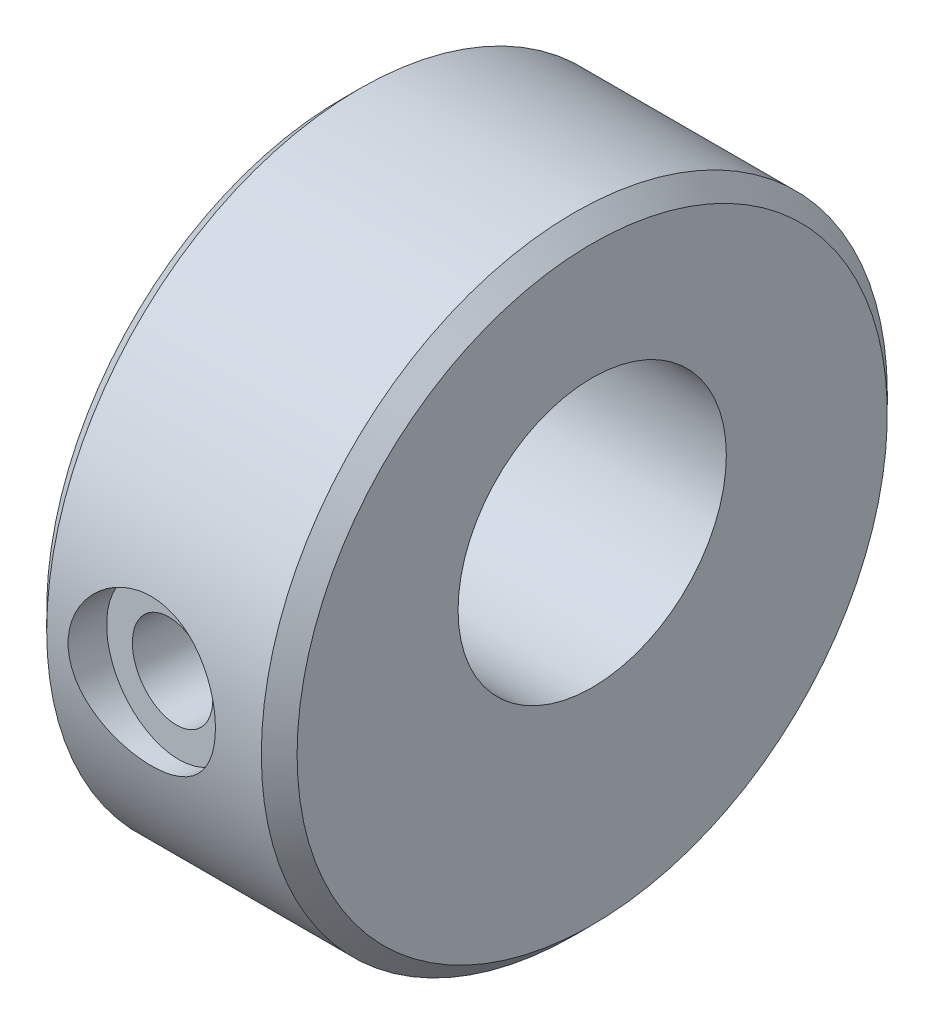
ISO-10303-21;
HEADER;
FILE_DESCRIPTION(('STEP AP214'),'2;1');
FILE_NAME('part.step','',(''),(''),'','','');
FILE_SCHEMA(('AUTOMOTIVE_DESIGN { 1 0 10303 214 1 1 1 1 }'));
ENDSEC;
DATA;
#1=APPLICATION_CONTEXT('core data for automotive mechanical design processes');
#2=APPLICATION_PROTOCOL_DEFINITION('international standard','automotive_design',2000,#1);
#3=PRODUCT_CONTEXT('',#1,'mechanical');
#4=PRODUCT('Part','Part','',(#3));
#5=PRODUCT_RELATED_PRODUCT_CATEGORY('part','',(#4));
#6=PRODUCT_DEFINITION_FORMATION('','',#4);
#7=PRODUCT_DEFINITION_CONTEXT('part definition',#1,'design');
#8=PRODUCT_DEFINITION('design','',#6,#7);
#9=PRODUCT_DEFINITION_SHAPE('','',#8);
#10=(LENGTH_UNIT() NAMED_UNIT(*) SI_UNIT(.MILLI.,.METRE.));
#11=(NAMED_UNIT(*) PLANE_ANGLE_UNIT() SI_UNIT($,.RADIAN.));
#12=(NAMED_UNIT(*) SI_UNIT($,.STERADIAN.) SOLID_ANGLE_UNIT());
#13=UNCERTAINTY_MEASURE_WITH_UNIT(LENGTH_MEASURE(1.E-05),#10,'distance_accuracy_value','');
#14=(GEOMETRIC_REPRESENTATION_CONTEXT(3) GLOBAL_UNCERTAINTY_ASSIGNED_CONTEXT((#13)) GLOBAL_UNIT_ASSIGNED_CONTEXT((#10,
#11,#12)) REPRESENTATION_CONTEXT('',''));
#15=CARTESIAN_POINT('',(0.,0.,0.));
#16=DIRECTION('',(0.,0.,1.));
#17=DIRECTION('',(1.,0.,0.));
#18=AXIS2_PLACEMENT_3D('',#15,#16,#17);
#19=CARTESIAN_POINT('',(6.46646795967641,0.,15.9263391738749));
#20=DIRECTION('',(0.095845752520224,0.,-0.995396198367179));
#21=DIRECTION('',(-0.995396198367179,0.,-0.095845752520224));
#22=AXIS2_PLACEMENT_3D('',#19,#20,#21);
#23=PLANE('',#22);
#24=CARTESIAN_POINT('',(6.46646795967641,0.,15.9263391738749));
#25=DIRECTION('',(-0.095845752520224,0.,0.995396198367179));
#26=DIRECTION('',(0.995396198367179,0.,0.095845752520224));
#27=AXIS2_PLACEMENT_3D('',#24,#25,#26);
#28=CIRCLE('',#27,2.5);
#29=CARTESIAN_POINT('',(8.95495845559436,0.,16.1659535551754));
#30=VERTEX_POINT('',#29);
#31=EDGE_CURVE('E81',#30,#30,#28,.F.);
#32=ORIENTED_EDGE('',*,*,#31,.T.);
#33=EDGE_LOOP('',(#32));
#34=FACE_BOUND('',#33,.T.);
#35=CARTESIAN_POINT('',(6.46646795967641,0.,15.9263391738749));
#36=DIRECTION('',(-0.095845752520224,0.,0.995396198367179));
#37=DIRECTION('',(0.995396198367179,0.,0.095845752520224));
#38=AXIS2_PLACEMENT_3D('',#35,#36,#37);
#39=CIRCLE('',#38,4.1);
#40=CARTESIAN_POINT('',(10.5475923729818,0.,16.3193067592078));
#41=VERTEX_POINT('',#40);
#42=EDGE_CURVE('E19',#41,#41,#39,.T.);
#43=ORIENTED_EDGE('',*,*,#42,.T.);
#44=EDGE_LOOP('',(#43));
#45=FACE_BOUND('',#44,.T.);
#46=ADVANCED_FACE('F15',(#34,#45),#23,.F.);
#47=CARTESIAN_POINT('',(6.37062220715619,0.,16.921735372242));
#48=DIRECTION('',(-0.095845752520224,0.,0.995396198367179));
#49=DIRECTION('',(0.995396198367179,0.,0.095845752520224));
#50=AXIS2_PLACEMENT_3D('',#47,#48,#49);
#51=CYLINDRICAL_SURFACE('',#50,4.1);
#52=CARTESIAN_POINT('',(6.36184056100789,4.1,17.0129362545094));
#53=CARTESIAN_POINT('',(6.47447080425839,4.0999995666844,17.012936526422));
#54=CARTESIAN_POINT('',(6.58711211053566,4.09539781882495,17.0140473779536));
#55=CARTESIAN_POINT('',(6.81163657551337,4.07697108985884,17.0184721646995));
#56=CARTESIAN_POINT('',(6.92351940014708,4.06314228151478,17.021787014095));
#57=CARTESIAN_POINT('',(7.14583961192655,4.02629447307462,17.0305405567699));
#58=CARTESIAN_POINT('',(7.25627477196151,4.00326271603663,17.0359821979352));
#59=CARTESIAN_POINT('',(7.47478490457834,3.94814200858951,17.0488408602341));
#60=CARTESIAN_POINT('',(7.58285898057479,3.91604967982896,17.05625861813));
#61=CARTESIAN_POINT('',(7.79569761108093,3.84307341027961,17.0728493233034));
#62=CARTESIAN_POINT('',(7.90046653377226,3.80220168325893,17.0820198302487));
#63=CARTESIAN_POINT('',(8.1061316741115,3.71193530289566,17.1018615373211));
#64=CARTESIAN_POINT('',(8.20702643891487,3.6625374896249,17.1125332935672));
#65=CARTESIAN_POINT('',(8.50270670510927,3.50211046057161,17.1463462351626));
#66=CARTESIAN_POINT('',(8.69077884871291,3.37874764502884,17.1713089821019));
#67=CARTESIAN_POINT('',(9.04484806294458,3.10176841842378,17.2235003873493));
#68=CARTESIAN_POINT('',(9.21067480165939,2.94793869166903,17.250744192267));
#69=CARTESIAN_POINT('',(9.51456471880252,2.61475267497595,17.3043779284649));
#70=CARTESIAN_POINT('',(9.6526239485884,2.43539276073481,17.3307677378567));
#71=CARTESIAN_POINT('',(9.89942512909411,2.05289513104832,17.3802575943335));
#72=CARTESIAN_POINT('',(10.0076536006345,1.84941806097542,17.4032971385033));
#73=CARTESIAN_POINT('',(10.1888851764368,1.42675912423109,17.4430321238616));
#74=CARTESIAN_POINT('',(10.2618891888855,1.20757766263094,17.4597277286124));
#75=CARTESIAN_POINT('',(10.3705858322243,0.759990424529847,17.4849238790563));
#76=CARTESIAN_POINT('',(10.4063267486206,0.53159698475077,17.4934350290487));
#77=CARTESIAN_POINT('',(10.439643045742,0.0718927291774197,17.501361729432));
#78=CARTESIAN_POINT('',(10.4372204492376,-0.159417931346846,17.500777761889));
#79=CARTESIAN_POINT('',(10.3944684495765,-0.616346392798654,17.4906239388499));
#80=CARTESIAN_POINT('',(10.3544554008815,-0.84199558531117,17.4811290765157));
#81=CARTESIAN_POINT('',(10.2380856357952,-1.28323887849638,17.4542881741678));
#82=CARTESIAN_POINT('',(10.1617273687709,-1.49883254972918,17.4369417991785));
#83=CARTESIAN_POINT('',(9.97443089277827,-1.91469433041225,17.3962009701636));
#84=CARTESIAN_POINT('',(9.86337219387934,-2.11490596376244,17.3727854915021));
#85=CARTESIAN_POINT('',(9.60955807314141,-2.49377633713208,17.3224598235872));
#86=CARTESIAN_POINT('',(9.46680248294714,-2.67243496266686,17.2955496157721));
#87=CARTESIAN_POINT('',(9.23128856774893,-2.92102428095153,17.2547037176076));
#88=CARTESIAN_POINT('',(9.1488122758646,-3.00096065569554,17.2409470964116));
#89=CARTESIAN_POINT('',(8.97733751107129,-3.1535314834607,17.2136930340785));
#90=CARTESIAN_POINT('',(8.88834150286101,-3.22616867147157,17.2001954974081));
#91=CARTESIAN_POINT('',(8.70435177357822,-3.36366698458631,17.1738363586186));
#92=CARTESIAN_POINT('',(8.6093538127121,-3.42852251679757,17.1609752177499));
#93=CARTESIAN_POINT('',(8.41410062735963,-3.54990580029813,17.1362774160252));
#94=CARTESIAN_POINT('',(8.31384748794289,-3.60643682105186,17.1244403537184));
#95=CARTESIAN_POINT('',(8.10950174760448,-3.7103990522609,17.1022146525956));
#96=CARTESIAN_POINT('',(8.00544236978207,-3.75789344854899,17.0918161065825));
#97=CARTESIAN_POINT('',(7.79358321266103,-3.84392353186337,17.0726739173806));
#98=CARTESIAN_POINT('',(7.68578492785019,-3.88246275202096,17.0639296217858));
#99=CARTESIAN_POINT('',(7.46736001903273,-3.95027614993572,17.0483585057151));
#100=CARTESIAN_POINT('',(7.35673795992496,-3.97956437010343,17.0415287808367));
#101=CARTESIAN_POINT('',(7.13336188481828,-4.02874578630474,17.0299691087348));
#102=CARTESIAN_POINT('',(7.02060882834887,-4.04864311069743,17.0252382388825));
#103=CARTESIAN_POINT('',(6.81686348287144,-4.07586013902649,17.0187400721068));
#104=CARTESIAN_POINT('',(6.72611164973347,-4.08491528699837,17.0165656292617));
#105=CARTESIAN_POINT('',(6.54418920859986,-4.09698529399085,17.0136636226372));
#106=CARTESIAN_POINT('',(6.45301862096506,-4.10000044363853,17.0129359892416));
#107=CARTESIAN_POINT('',(6.24594192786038,-4.09999943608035,17.0129365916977));
#108=CARTESIAN_POINT('',(6.13003122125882,-4.09512640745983,17.0141130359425));
#109=CARTESIAN_POINT('',(5.89902443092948,-4.075727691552,17.0187702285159));
#110=CARTESIAN_POINT('',(5.78392874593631,-4.06119757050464,17.0222520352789));
#111=CARTESIAN_POINT('',(5.55523368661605,-4.02261661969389,17.0314107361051));
#112=CARTESIAN_POINT('',(5.44163703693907,-3.99855041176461,17.037091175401));
#113=CARTESIAN_POINT('',(5.21692003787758,-3.94114166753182,17.0504621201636));
#114=CARTESIAN_POINT('',(5.10580067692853,-3.90779549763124,17.0581534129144));
#115=CARTESIAN_POINT('',(4.77788556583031,-3.79442626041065,17.0838640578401));
#116=CARTESIAN_POINT('',(4.56577860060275,-3.70094356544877,17.1045527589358));
#117=CARTESIAN_POINT('',(4.16025234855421,-3.48098245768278,17.150664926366));
#118=CARTESIAN_POINT('',(3.9668278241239,-3.35451332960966,17.1760870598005));
#119=CARTESIAN_POINT('',(3.59896117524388,-3.06833558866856,17.2295377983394));
#120=CARTESIAN_POINT('',(3.4250946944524,-2.9078937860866,17.2576147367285));
#121=CARTESIAN_POINT('',(3.10688796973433,-2.55978508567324,17.3126685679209));
#122=CARTESIAN_POINT('',(2.96255056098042,-2.37211557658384,17.3396453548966));
#123=CARTESIAN_POINT('',(2.70816837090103,-1.9746581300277,17.3893851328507));
#124=CARTESIAN_POINT('',(2.59807233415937,-1.764903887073,17.4121544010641));
#125=CARTESIAN_POINT('',(2.4159101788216,-1.32889928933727,17.4508400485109));
#126=CARTESIAN_POINT('',(2.34383147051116,-1.10265442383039,17.4667586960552));
#127=CARTESIAN_POINT('',(2.24281693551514,-0.650438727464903,17.4893103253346));
#128=CARTESIAN_POINT('',(2.21217200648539,-0.424867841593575,17.4963104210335));
#129=CARTESIAN_POINT('',(2.18964221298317,0.028280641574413,17.5014426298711));
#130=CARTESIAN_POINT('',(2.19774895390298,0.255857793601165,17.4995766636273));
#131=CARTESIAN_POINT('',(2.25146078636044,0.698657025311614,17.4874059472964));
#132=CARTESIAN_POINT('',(2.29582400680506,0.914039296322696,17.4773807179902));
#133=CARTESIAN_POINT('',(2.41880561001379,1.33430924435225,17.4503293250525));
#134=CARTESIAN_POINT('',(2.49742671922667,1.53919608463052,17.4333026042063));
#135=CARTESIAN_POINT('',(2.68777805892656,1.93641824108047,17.3937000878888));
#136=CARTESIAN_POINT('',(2.80001805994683,2.12850018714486,17.3710398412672));
#137=CARTESIAN_POINT('',(3.05366180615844,2.49188595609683,17.3226488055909));
#138=CARTESIAN_POINT('',(3.1950704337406,2.66318629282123,17.2969175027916));
#139=CARTESIAN_POINT('',(3.51018585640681,2.98837848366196,17.2437812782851));
#140=CARTESIAN_POINT('',(3.6850672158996,3.14112743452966,17.2163534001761));
#141=CARTESIAN_POINT('',(4.05800468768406,3.41608690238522,17.1639162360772));
#142=CARTESIAN_POINT('',(4.25607495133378,3.5382786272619,17.1389084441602));
#143=CARTESIAN_POINT('',(4.56895350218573,3.69734913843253,17.1050468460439));
#144=CARTESIAN_POINT('',(4.67734001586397,3.74679700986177,17.09425669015));
#145=CARTESIAN_POINT('',(4.89802811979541,3.8363916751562,17.0743729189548));
#146=CARTESIAN_POINT('',(5.01032818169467,3.87654205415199,17.0652786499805));
#147=CARTESIAN_POINT('',(5.23785549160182,3.94713584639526,17.0490887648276));
#148=CARTESIAN_POINT('',(5.35307728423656,3.97759609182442,17.0419896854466));
#149=CARTESIAN_POINT('',(5.58576028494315,4.02860686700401,17.0300034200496));
#150=CARTESIAN_POINT('',(5.70322035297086,4.04916230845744,17.0251151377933));
#151=CARTESIAN_POINT('',(5.91090930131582,4.07640222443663,17.0186099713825));
#152=CARTESIAN_POINT('',(6.0008461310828,4.08524006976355,17.0164875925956));
#153=CARTESIAN_POINT('',(6.18113310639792,4.09703928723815,17.0136505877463));
#154=CARTESIAN_POINT('',(6.27148327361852,4.10000034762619,17.0129360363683));
#155=CARTESIAN_POINT('',(6.36184056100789,4.1,17.0129362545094));
#156=B_SPLINE_CURVE_WITH_KNOTS('',3,(#52,#53,#54,#55,#56,#57,#58,#59,#60,#61,#62,#63,#64,#65,
#66,#67,#68,#69,#70,#71,#72,#73,#74,#75,#76,#77,#78,#79,#80,#81,#82,#83,#84,#85,#86,#87,#88,#89,
#90,#91,#92,#93,#94,#95,#96,#97,#98,#99,#100,#101,#102,#103,#104,#105,#106,#107,#108,#109,#110,
#111,#112,#113,#114,#115,#116,#117,#118,#119,#120,#121,#122,#123,#124,#125,#126,#127,#128,#129,
#130,#131,#132,#133,#134,#135,#136,#137,#138,#139,#140,#141,#142,#143,#144,#145,#146,#147,#148,
#149,#150,#151,#152,#153,#154,#155),.UNSPECIFIED.,.T.,.F.,(4,2,2,2,2,2,2,2,2,2,2,2,2,2,2,2,2,2,
2,2,2,2,2,2,2,2,2,2,2,2,2,2,2,2,2,2,2,2,2,2,2,2,2,2,2,2,2,2,2,2,2,4),(0.,0.337809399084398,
0.675759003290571,1.01417870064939,1.35272474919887,1.69080283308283,2.02900648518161,
2.70450038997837,3.38490257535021,4.06540144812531,4.75697084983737,5.44852241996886,
6.13917675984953,6.82979449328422,7.51465168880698,8.19953810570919,8.88682958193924,
9.57412470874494,9.92081784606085,10.2673805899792,10.6141909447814,10.9608647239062,
11.3050174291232,11.6490341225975,11.9925260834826,12.3358668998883,12.6093461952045,
12.8828123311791,13.2304217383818,13.5781908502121,13.9265230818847,14.2749918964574,
14.9696607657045,15.6641343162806,16.3754873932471,17.0869087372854,17.7972599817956,
18.5073758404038,19.1872019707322,19.866880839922,20.5242089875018,21.1815894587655,
21.849491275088,22.5175049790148,23.2158359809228,23.9145953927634,24.2730957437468,
24.6314576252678,24.9891935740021,25.3467519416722,25.6177441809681,25.8887507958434),.UNSPECIFIED.);
#157=CARTESIAN_POINT('',(6.36184056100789,4.1,17.0129362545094));
#158=VERTEX_POINT('',#157);
#159=EDGE_CURVE('E44',#158,#158,#156,.T.);
#160=ORIENTED_EDGE('',*,*,#159,.F.);
#161=EDGE_LOOP('',(#160));
#162=FACE_BOUND('',#161,.T.);
#163=ORIENTED_EDGE('',*,*,#42,.F.);
#164=EDGE_LOOP('',(#163));
#165=FACE_BOUND('',#164,.T.);
#166=ADVANCED_FACE('F91',(#162,#165),#51,.F.);
#167=CARTESIAN_POINT('',(13.,0.,0.));
#168=DIRECTION('',(-1.,0.,0.));
#169=DIRECTION('',(0.,0.,1.));
#170=AXIS2_PLACEMENT_3D('',#167,#168,#169);
#171=CONICAL_SURFACE('',#170,17.5,0.785398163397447);
#172=CARTESIAN_POINT('',(13.,0.,0.));
#173=DIRECTION('',(1.,0.,0.));
#174=DIRECTION('',(0.,0.,-1.));
#175=AXIS2_PLACEMENT_3D('',#172,#173,#174);
#176=CIRCLE('',#175,17.5);
#177=CARTESIAN_POINT('',(13.,0.,-17.5));
#178=VERTEX_POINT('',#177);
#179=EDGE_CURVE('E31',#178,#178,#176,.F.);
#180=ORIENTED_EDGE('',*,*,#179,.F.);
#181=EDGE_LOOP('',(#180));
#182=FACE_BOUND('',#181,.T.);
#183=CARTESIAN_POINT('',(14.,0.,0.));
#184=DIRECTION('',(-1.,0.,0.));
#185=DIRECTION('',(0.,0.,1.));
#186=AXIS2_PLACEMENT_3D('',#183,#184,#185);
#187=CIRCLE('',#186,16.5);
#188=CARTESIAN_POINT('',(14.,0.,16.5));
#189=VERTEX_POINT('',#188);
#190=EDGE_CURVE('E78',#189,#189,#187,.F.);
#191=ORIENTED_EDGE('',*,*,#190,.F.);
#192=EDGE_LOOP('',(#191));
#193=FACE_BOUND('',#192,.T.);
#194=ADVANCED_FACE('F93',(#182,#193),#171,.T.);
#195=CARTESIAN_POINT('',(11.2323031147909,0.,-33.5687513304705));
#196=DIRECTION('',(-0.095845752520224,0.,0.995396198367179));
#197=DIRECTION('',(0.995396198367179,0.,0.095845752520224));
#198=AXIS2_PLACEMENT_3D('',#195,#196,#197);
#199=CYLINDRICAL_SURFACE('',#198,2.5);
#200=CARTESIAN_POINT('',(7.46172785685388,-2.5,5.59016994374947));
#201=CARTESIAN_POINT('',(7.39917202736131,-2.4999999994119,5.59016999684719));
#202=CARTESIAN_POINT('',(7.33661571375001,-2.49766795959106,5.59225875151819));
#203=CARTESIAN_POINT('',(7.2120881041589,-2.4884862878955,5.60044973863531));
#204=CARTESIAN_POINT('',(7.15011714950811,-2.4816341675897,5.60655418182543));
#205=CARTESIAN_POINT('',(6.96566731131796,-2.45456729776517,5.63053079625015));
#206=CARTESIAN_POINT('',(6.8448073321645,-2.42784291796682,5.65406513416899));
#207=CARTESIAN_POINT('',(6.61195824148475,-2.35968735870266,5.71273970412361));
#208=CARTESIAN_POINT('',(6.49989083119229,-2.31840989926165,5.74775837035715));
#209=CARTESIAN_POINT('',(6.28455539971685,-2.22316795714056,5.8262768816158));
#210=CARTESIAN_POINT('',(6.18128932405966,-2.16920067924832,5.86977859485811));
#211=CARTESIAN_POINT('',(5.94128979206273,-2.02419835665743,5.98275110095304));
#212=CARTESIAN_POINT('',(5.8095520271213,-1.92725315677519,6.0552839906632));
#213=CARTESIAN_POINT('',(5.56687348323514,-1.71348459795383,6.20594152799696));
#214=CARTESIAN_POINT('',(5.45596765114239,-1.59662845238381,6.28407527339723));
#215=CARTESIAN_POINT('',(5.25629184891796,-1.34421165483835,6.44160976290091));
#216=CARTESIAN_POINT('',(5.16769506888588,-1.20851662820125,6.52101561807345));
#217=CARTESIAN_POINT('',(5.01696613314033,-0.921357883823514,6.67613898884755));
#218=CARTESIAN_POINT('',(4.95479434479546,-0.769918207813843,6.75186187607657));
#219=CARTESIAN_POINT('',(4.86941337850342,-0.483072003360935,6.88269291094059));
#220=CARTESIAN_POINT('',(4.84118621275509,-0.349730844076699,6.93905050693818));
#221=CARTESIAN_POINT('',(4.80757000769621,-0.077440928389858,7.04471889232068));
#222=CARTESIAN_POINT('',(4.80216866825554,0.0615047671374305,7.09403346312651));
#223=CARTESIAN_POINT('',(4.81622619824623,0.341775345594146,7.1842775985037));
#224=CARTESIAN_POINT('',(4.83581900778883,0.483109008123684,7.2251606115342));
#225=CARTESIAN_POINT('',(4.90099434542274,0.76221458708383,7.29731869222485));
#226=CARTESIAN_POINT('',(4.94656704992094,0.899987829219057,7.32859738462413));
#227=CARTESIAN_POINT('',(5.05728499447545,1.15352978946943,7.37916927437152));
#228=CARTESIAN_POINT('',(5.12012425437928,1.2701401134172,7.3993262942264));
#229=CARTESIAN_POINT('',(5.26467310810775,1.49207405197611,7.43281160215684));
#230=CARTESIAN_POINT('',(5.34637996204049,1.59739930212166,7.44614088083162));
#231=CARTESIAN_POINT('',(5.52466568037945,1.79188718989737,7.46712850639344));
#232=CARTESIAN_POINT('',(5.62096842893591,1.88129392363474,7.47487931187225));
#233=CARTESIAN_POINT('',(5.82671882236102,2.04379612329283,7.48655673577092));
#234=CARTESIAN_POINT('',(5.9361723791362,2.11688421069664,7.49048162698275));
#235=CARTESIAN_POINT('',(6.16985114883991,2.24753045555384,7.49604696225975));
#236=CARTESIAN_POINT('',(6.29449343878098,2.30434570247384,7.49758916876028));
#237=CARTESIAN_POINT('',(6.55123912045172,2.39693314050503,7.49943605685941));
#238=CARTESIAN_POINT('',(6.68333314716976,2.43273112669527,7.49974225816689));
#239=CARTESIAN_POINT('',(6.89324991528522,2.47171493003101,7.49995841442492));
#240=CARTESIAN_POINT('',(6.96977004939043,2.48231103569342,7.4999826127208));
#241=CARTESIAN_POINT('',(7.12345837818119,2.49645550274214,7.50000235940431));
#242=CARTESIAN_POINT('',(7.20062658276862,2.50000375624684,7.4999979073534));
#243=CARTESIAN_POINT('',(7.41957492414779,2.49999310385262,7.50000384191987));
#244=CARTESIAN_POINT('',(7.5614436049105,2.4880138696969,7.50002974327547));
#245=CARTESIAN_POINT('',(7.84129398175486,2.44038202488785,7.49979934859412));
#246=CARTESIAN_POINT('',(7.9792697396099,2.40469509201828,7.49954264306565));
#247=CARTESIAN_POINT('',(8.24720669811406,2.31069380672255,7.49775699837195));
#248=CARTESIAN_POINT('',(8.37717238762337,2.25239226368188,7.49622877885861));
#249=CARTESIAN_POINT('',(8.62544748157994,2.11494598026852,7.49042325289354));
#250=CARTESIAN_POINT('',(8.74376050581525,2.03580774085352,7.48614680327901));
#251=CARTESIAN_POINT('',(8.96544456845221,1.85919498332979,7.4730971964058));
#252=CARTESIAN_POINT('',(9.06882176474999,1.76172806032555,7.46432589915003));
#253=CARTESIAN_POINT('',(9.25789988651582,1.55159855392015,7.44054353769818));
#254=CARTESIAN_POINT('',(9.34360156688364,1.43893661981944,7.42553274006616));
#255=CARTESIAN_POINT('',(9.49489398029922,1.20265381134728,7.38790388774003));
#256=CARTESIAN_POINT('',(9.56056598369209,1.07907991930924,7.36531737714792));
#257=CARTESIAN_POINT('',(9.67097913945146,0.824665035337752,7.31164432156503));
#258=CARTESIAN_POINT('',(9.71572060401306,0.693824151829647,7.28055790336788));
#259=CARTESIAN_POINT('',(9.78413960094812,0.427901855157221,7.20940386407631));
#260=CARTESIAN_POINT('',(9.80763868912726,0.292794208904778,7.16926363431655));
#261=CARTESIAN_POINT('',(9.83332534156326,0.0232965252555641,7.08068352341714));
#262=CARTESIAN_POINT('',(9.83550775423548,-0.111093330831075,7.03224163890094));
#263=CARTESIAN_POINT('',(9.81910149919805,-0.382507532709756,6.92556623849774));
#264=CARTESIAN_POINT('',(9.79945516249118,-0.519320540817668,6.86696104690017));
#265=CARTESIAN_POINT('',(9.73909110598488,-0.785349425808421,6.74373829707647));
#266=CARTESIAN_POINT('',(9.69836743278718,-0.914563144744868,6.67911904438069));
#267=CARTESIAN_POINT('',(9.59290476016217,-1.1734310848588,6.5405811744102));
#268=CARTESIAN_POINT('',(9.52643430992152,-1.30220870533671,6.46633750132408));
#269=CARTESIAN_POINT('',(9.37149858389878,-1.54548899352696,6.31699700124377));
#270=CARTESIAN_POINT('',(9.28300265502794,-1.65997143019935,6.24189912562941));
#271=CARTESIAN_POINT('',(9.08076690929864,-1.87601530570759,6.09248169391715));
#272=CARTESIAN_POINT('',(8.96617824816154,-1.97689996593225,6.01830633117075));
#273=CARTESIAN_POINT('',(8.77801292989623,-2.11116239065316,5.91526895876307));
#274=CARTESIAN_POINT('',(8.7126194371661,-2.15305336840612,5.88231059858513));
#275=CARTESIAN_POINT('',(8.57659654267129,-2.2305991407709,5.82012784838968));
#276=CARTESIAN_POINT('',(8.50597063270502,-2.26625804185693,5.79090100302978));
#277=CARTESIAN_POINT('',(8.33671089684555,-2.34088314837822,5.72877861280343));
#278=CARTESIAN_POINT('',(8.23628411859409,-2.37732778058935,5.69764679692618));
#279=CARTESIAN_POINT('',(8.02897152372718,-2.43660626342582,5.64636917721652));
#280=CARTESIAN_POINT('',(7.92210206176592,-2.45947310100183,5.62619675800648));
#281=CARTESIAN_POINT('',(7.75554256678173,-2.48337069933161,5.60500884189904));
#282=CARTESIAN_POINT('',(7.69711004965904,-2.48961174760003,5.5994465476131));
#283=CARTESIAN_POINT('',(7.57969450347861,-2.49792670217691,5.59202680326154));
#284=CARTESIAN_POINT('',(7.52071139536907,-2.50000000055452,5.59016989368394));
#285=CARTESIAN_POINT('',(7.46172785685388,-2.5,5.59016994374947));
#286=B_SPLINE_CURVE_WITH_KNOTS('',3,(#200,#201,#202,#203,#204,#205,#206,#207,#208,#209,#210,
#211,#212,#213,#214,#215,#216,#217,#218,#219,#220,#221,#222,#223,#224,#225,#226,#227,#228,#229,
#230,#231,#232,#233,#234,#235,#236,#237,#238,#239,#240,#241,#242,#243,#244,#245,#246,#247,#248,
#249,#250,#251,#252,#253,#254,#255,#256,#257,#258,#259,#260,#261,#262,#263,#264,#265,#266,#267,
#268,#269,#270,#271,#272,#273,#274,#275,#276,#277,#278,#279,#280,#281,#282,#283,#284,#285),
.UNSPECIFIED.,.T.,.F.,(4,2,2,2,2,2,2,2,2,2,2,2,2,2,2,2,2,2,2,2,2,2,2,2,2,2,2,2,2,2,2,2,2,2,2,2,
2,2,2,2,2,2,4),(0.,0.187588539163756,0.375280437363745,0.751124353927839,1.12311174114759,
1.49518114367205,2.02918965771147,2.56408615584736,3.10301533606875,3.64113334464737,
4.08176806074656,4.52216530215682,4.96493251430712,5.40753241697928,5.80753309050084,
6.20747571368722,6.60062660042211,6.99395489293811,7.40310406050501,7.8117500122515,
8.04320859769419,8.27467072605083,8.69961536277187,9.1251765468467,9.55049703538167,
9.97568498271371,10.4006971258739,10.8256911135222,11.2489370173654,11.6721766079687,
12.0989393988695,12.5258053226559,12.9742923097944,13.4229060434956,13.9092427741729,
14.3962601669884,14.9022429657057,15.1549457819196,15.4074814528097,15.7398961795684,
16.0714999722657,16.2483503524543,16.4252265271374),.UNSPECIFIED.);
#287=CARTESIAN_POINT('',(7.46172785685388,-2.5,5.59016994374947));
#288=VERTEX_POINT('',#287);
#289=EDGE_CURVE('E37',#288,#288,#286,.T.);
#290=ORIENTED_EDGE('',*,*,#289,.T.);
#291=EDGE_LOOP('',(#290));
#292=FACE_BOUND('',#291,.T.);
#293=ORIENTED_EDGE('',*,*,#31,.F.);
#294=EDGE_LOOP('',(#293));
#295=FACE_BOUND('',#294,.T.);
#296=ADVANCED_FACE('F50',(#292,#295),#199,.F.);
#297=CARTESIAN_POINT('',(14.,8.75,0.));
#298=DIRECTION('',(1.,0.,0.));
#299=DIRECTION('',(0.,0.,-1.));
#300=AXIS2_PLACEMENT_3D('',#297,#298,#299);
#301=PLANE('',#300);
#302=ORIENTED_EDGE('',*,*,#190,.T.);
#303=EDGE_LOOP('',(#302));
#304=FACE_BOUND('',#303,.T.);
#305=CARTESIAN_POINT('',(14.,2.5,0.));
#306=DIRECTION('',(1.,0.,0.));
#307=DIRECTION('',(0.,0.,-1.));
#308=AXIS2_PLACEMENT_3D('',#305,#306,#307);
#309=CIRCLE('',#308,7.5);
#310=CARTESIAN_POINT('',(14.,2.5,-7.5));
#311=VERTEX_POINT('',#310);
#312=EDGE_CURVE('E34',#311,#311,#309,.F.);
#313=ORIENTED_EDGE('',*,*,#312,.T.);
#314=EDGE_LOOP('',(#313));
#315=FACE_BOUND('',#314,.T.);
#316=ADVANCED_FACE('F73',(#304,#315),#301,.T.);
#317=CARTESIAN_POINT('',(7.,0.,0.));
#318=DIRECTION('',(1.,0.,0.));
#319=DIRECTION('',(0.,0.,-1.));
#320=AXIS2_PLACEMENT_3D('',#317,#318,#319);
#321=CYLINDRICAL_SURFACE('',#320,17.5);
#322=ORIENTED_EDGE('',*,*,#179,.T.);
#323=EDGE_LOOP('',(#322));
#324=FACE_BOUND('',#323,.T.);
#325=CARTESIAN_POINT('',(0.999999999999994,0.,0.));
#326=DIRECTION('',(1.,0.,0.));
#327=DIRECTION('',(0.,-1.,0.));
#328=AXIS2_PLACEMENT_3D('',#325,#326,#327);
#329=CIRCLE('',#328,17.5);
#330=CARTESIAN_POINT('',(0.999999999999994,-17.5,0.));
#331=VERTEX_POINT('',#330);
#332=EDGE_CURVE('E28',#331,#331,#329,.F.);
#333=ORIENTED_EDGE('',*,*,#332,.F.);
#334=EDGE_LOOP('',(#333));
#335=FACE_BOUND('',#334,.T.);
#336=ORIENTED_EDGE('',*,*,#159,.T.);
#337=EDGE_LOOP('',(#336));
#338=FACE_BOUND('',#337,.T.);
#339=ADVANCED_FACE('F58',(#324,#335,#338),#321,.T.);
#340=CARTESIAN_POINT('',(-37.4392845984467,2.5,0.));
#341=DIRECTION('',(1.,0.,0.));
#342=DIRECTION('',(0.,0.,-1.));
#343=AXIS2_PLACEMENT_3D('',#340,#341,#342);
#344=CYLINDRICAL_SURFACE('',#343,7.5);
#345=ORIENTED_EDGE('',*,*,#289,.F.);
#346=EDGE_LOOP('',(#345));
#347=FACE_BOUND('',#346,.T.);
#348=ORIENTED_EDGE('',*,*,#312,.F.);
#349=EDGE_LOOP('',(#348));
#350=FACE_BOUND('',#349,.T.);
#351=CARTESIAN_POINT('',(0.,2.5,0.));
#352=DIRECTION('',(1.,0.,0.));
#353=DIRECTION('',(0.,0.,-1.));
#354=AXIS2_PLACEMENT_3D('',#351,#352,#353);
#355=CIRCLE('',#354,7.5);
#356=CARTESIAN_POINT('',(0.,2.5,-7.5));
#357=VERTEX_POINT('',#356);
#358=EDGE_CURVE('E23',#357,#357,#355,.T.);
#359=ORIENTED_EDGE('',*,*,#358,.F.);
#360=EDGE_LOOP('',(#359));
#361=FACE_BOUND('',#360,.T.);
#362=ADVANCED_FACE('F54',(#347,#350,#361),#344,.F.);
#363=CARTESIAN_POINT('',(0.999999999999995,0.,0.));
#364=DIRECTION('',(1.,0.,0.));
#365=DIRECTION('',(0.,0.,-1.));
#366=AXIS2_PLACEMENT_3D('',#363,#364,#365);
#367=CONICAL_SURFACE('',#366,17.5,0.78539816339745);
#368=CARTESIAN_POINT('',(0.,0.,0.));
#369=DIRECTION('',(1.,0.,0.));
#370=DIRECTION('',(0.,0.,-1.));
#371=AXIS2_PLACEMENT_3D('',#368,#369,#370);
#372=CIRCLE('',#371,16.5);
#373=CARTESIAN_POINT('',(0.,0.,-16.5));
#374=VERTEX_POINT('',#373);
#375=EDGE_CURVE('E10',#374,#374,#372,.F.);
#376=ORIENTED_EDGE('',*,*,#375,.F.);
#377=EDGE_LOOP('',(#376));
#378=FACE_BOUND('',#377,.T.);
#379=ORIENTED_EDGE('',*,*,#332,.T.);
#380=EDGE_LOOP('',(#379));
#381=FACE_BOUND('',#380,.T.);
#382=ADVANCED_FACE('F57',(#378,#381),#367,.T.);
#383=CARTESIAN_POINT('',(0.,8.75,0.));
#384=DIRECTION('',(-1.,0.,0.));
#385=DIRECTION('',(0.,0.,1.));
#386=AXIS2_PLACEMENT_3D('',#383,#384,#385);
#387=PLANE('',#386);
#388=ORIENTED_EDGE('',*,*,#375,.T.);
#389=EDGE_LOOP('',(#388));
#390=FACE_BOUND('',#389,.T.);
#391=ORIENTED_EDGE('',*,*,#358,.T.);
#392=EDGE_LOOP('',(#391));
#393=FACE_BOUND('',#392,.T.);
#394=ADVANCED_FACE('F17',(#390,#393),#387,.T.);
#395=CLOSED_SHELL('',(#46,#166,#194,#296,#316,#339,#362,#382,#394));
#396=MANIFOLD_SOLID_BREP('B1',#395);
#397=ADVANCED_BREP_SHAPE_REPRESENTATION('',(#18,#396),#14);
#398=SHAPE_DEFINITION_REPRESENTATION(#9,#397);
ENDSEC;
END-ISO-10303-21;
